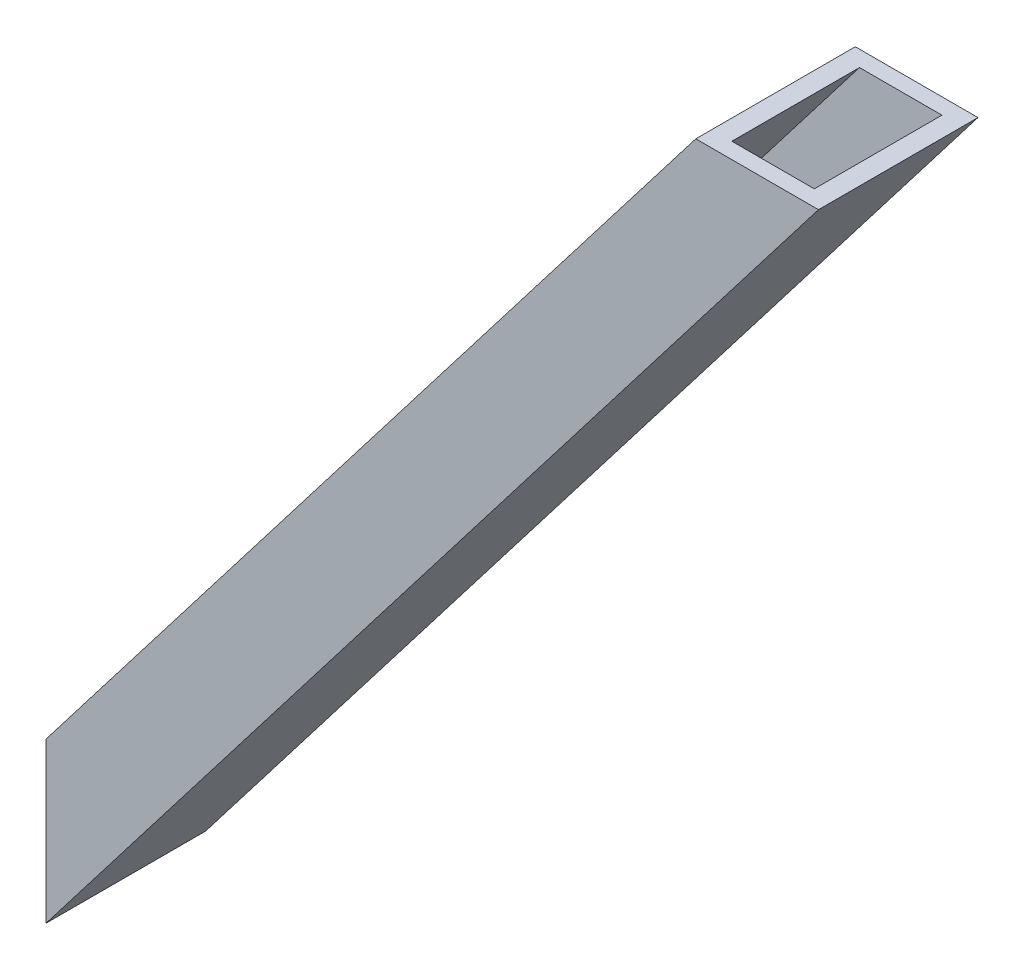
ISO-10303-21;
HEADER;
FILE_DESCRIPTION(('STEP AP214'),'2;1');
FILE_NAME('part.step','',(''),(''),'','','');
FILE_SCHEMA(('AUTOMOTIVE_DESIGN { 1 0 10303 214 1 1 1 1 }'));
ENDSEC;
DATA;
#1=APPLICATION_CONTEXT('core data for automotive mechanical design processes');
#2=APPLICATION_PROTOCOL_DEFINITION('international standard','automotive_design',2000,#1);
#3=PRODUCT_CONTEXT('',#1,'mechanical');
#4=PRODUCT('Part','Part','',(#3));
#5=PRODUCT_RELATED_PRODUCT_CATEGORY('part','',(#4));
#6=PRODUCT_DEFINITION_FORMATION('','',#4);
#7=PRODUCT_DEFINITION_CONTEXT('part definition',#1,'design');
#8=PRODUCT_DEFINITION('design','',#6,#7);
#9=PRODUCT_DEFINITION_SHAPE('','',#8);
#10=(LENGTH_UNIT() NAMED_UNIT(*) SI_UNIT(.MILLI.,.METRE.));
#11=(NAMED_UNIT(*) PLANE_ANGLE_UNIT() SI_UNIT($,.RADIAN.));
#12=(NAMED_UNIT(*) SI_UNIT($,.STERADIAN.) SOLID_ANGLE_UNIT());
#13=UNCERTAINTY_MEASURE_WITH_UNIT(LENGTH_MEASURE(1.E-05),#10,'distance_accuracy_value','');
#14=(GEOMETRIC_REPRESENTATION_CONTEXT(3) GLOBAL_UNCERTAINTY_ASSIGNED_CONTEXT((#13)) GLOBAL_UNIT_ASSIGNED_CONTEXT((#10,
#11,#12)) REPRESENTATION_CONTEXT('',''));
#15=CARTESIAN_POINT('',(0.,0.,0.));
#16=DIRECTION('',(0.,0.,1.));
#17=DIRECTION('',(1.,0.,0.));
#18=AXIS2_PLACEMENT_3D('',#15,#16,#17);
#19=CARTESIAN_POINT('',(0.,0.,20.));
#20=DIRECTION('',(1.,0.,0.));
#21=DIRECTION('',(0.,0.,-1.));
#22=AXIS2_PLACEMENT_3D('',#19,#20,#21);
#23=PLANE('',#22);
#24=DIRECTION('',(0.,-1.,0.));
#25=VECTOR('',#24,1.);
#26=CARTESIAN_POINT('',(0.,0.,0.));
#27=LINE('',#26,#25);
#28=CARTESIAN_POINT('',(0.,20.,0.));
#29=VERTEX_POINT('',#28);
#30=CARTESIAN_POINT('',(0.,0.,0.));
#31=VERTEX_POINT('',#30);
#32=EDGE_CURVE('E128',#29,#31,#27,.T.);
#33=ORIENTED_EDGE('',*,*,#32,.T.);
#34=DIRECTION('',(0.,0.,-1.));
#35=VECTOR('',#34,1.);
#36=CARTESIAN_POINT('',(0.,0.,20.));
#37=LINE('',#36,#35);
#38=CARTESIAN_POINT('',(0.,0.,20.));
#39=VERTEX_POINT('',#38);
#40=EDGE_CURVE('E45',#39,#31,#37,.T.);
#41=ORIENTED_EDGE('',*,*,#40,.F.);
#42=DIRECTION('',(0.,-1.,0.));
#43=VECTOR('',#42,1.);
#44=CARTESIAN_POINT('',(0.,0.,20.));
#45=LINE('',#44,#43);
#46=CARTESIAN_POINT('',(0.,20.,20.));
#47=VERTEX_POINT('',#46);
#48=EDGE_CURVE('E125',#47,#39,#45,.T.);
#49=ORIENTED_EDGE('',*,*,#48,.F.);
#50=DIRECTION('',(0.,0.,-1.));
#51=VECTOR('',#50,1.);
#52=CARTESIAN_POINT('',(0.,20.,20.));
#53=LINE('',#52,#51);
#54=EDGE_CURVE('E11',#47,#29,#53,.T.);
#55=ORIENTED_EDGE('',*,*,#54,.T.);
#56=EDGE_LOOP('',(#33,#41,#49,#55));
#57=FACE_BOUND('',#56,.T.);
#58=DIRECTION('',(0.,-1.,0.));
#59=VECTOR('',#58,1.);
#60=CARTESIAN_POINT('',(0.,0.,2.));
#61=LINE('',#60,#59);
#62=CARTESIAN_POINT('',(0.,16.7197561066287,2.));
#63=VERTEX_POINT('',#62);
#64=CARTESIAN_POINT('',(0.,3.28024389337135,2.));
#65=VERTEX_POINT('',#64);
#66=EDGE_CURVE('E158',#63,#65,#61,.T.);
#67=ORIENTED_EDGE('',*,*,#66,.F.);
#68=DIRECTION('',(0.,0.,-1.));
#69=VECTOR('',#68,1.);
#70=CARTESIAN_POINT('',(0.,16.7197561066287,20.));
#71=LINE('',#70,#69);
#72=CARTESIAN_POINT('',(0.,16.7197561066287,18.));
#73=VERTEX_POINT('',#72);
#74=EDGE_CURVE('E136',#73,#63,#71,.T.);
#75=ORIENTED_EDGE('',*,*,#74,.F.);
#76=DIRECTION('',(0.,-1.,0.));
#77=VECTOR('',#76,1.);
#78=CARTESIAN_POINT('',(0.,0.,18.));
#79=LINE('',#78,#77);
#80=CARTESIAN_POINT('',(0.,3.28024389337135,18.));
#81=VERTEX_POINT('',#80);
#82=EDGE_CURVE('E161',#73,#81,#79,.T.);
#83=ORIENTED_EDGE('',*,*,#82,.T.);
#84=DIRECTION('',(0.,0.,-1.));
#85=VECTOR('',#84,1.);
#86=CARTESIAN_POINT('',(0.,3.28024389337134,20.));
#87=LINE('',#86,#85);
#88=EDGE_CURVE('E162',#81,#65,#87,.T.);
#89=ORIENTED_EDGE('',*,*,#88,.T.);
#90=EDGE_LOOP('',(#67,#75,#83,#89));
#91=FACE_BOUND('',#90,.T.);
#92=ADVANCED_FACE('F37',(#57,#91),#23,.F.);
#93=CARTESIAN_POINT('',(100.,130.,20.));
#94=DIRECTION('',(-0.7926239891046,0.609710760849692,0.));
#95=DIRECTION('',(-0.609710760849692,-0.7926239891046,0.));
#96=AXIS2_PLACEMENT_3D('',#93,#94,#95);
#97=PLANE('',#96);
#98=DIRECTION('',(0.609710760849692,0.7926239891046,0.));
#99=VECTOR('',#98,1.);
#100=CARTESIAN_POINT('',(100.,130.,0.));
#101=LINE('',#100,#99);
#102=CARTESIAN_POINT('',(96.8585663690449,125.916136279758,0.));
#103=VERTEX_POINT('',#102);
#104=EDGE_CURVE('E132',#31,#103,#101,.T.);
#105=ORIENTED_EDGE('',*,*,#104,.T.);
#106=DIRECTION('',(0.,0.,1.));
#107=VECTOR('',#106,1.);
#108=CARTESIAN_POINT('',(96.8585663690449,125.916136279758,-1.));
#109=LINE('',#108,#107);
#110=CARTESIAN_POINT('',(96.8585663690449,125.916136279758,20.));
#111=VERTEX_POINT('',#110);
#112=EDGE_CURVE('E121',#103,#111,#109,.T.);
#113=ORIENTED_EDGE('',*,*,#112,.T.);
#114=DIRECTION('',(0.609710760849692,0.7926239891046,0.));
#115=VECTOR('',#114,1.);
#116=CARTESIAN_POINT('',(100.,130.,20.));
#117=LINE('',#116,#115);
#118=EDGE_CURVE('E120',#39,#111,#117,.T.);
#119=ORIENTED_EDGE('',*,*,#118,.F.);
#120=ORIENTED_EDGE('',*,*,#40,.T.);
#121=EDGE_LOOP('',(#105,#113,#119,#120));
#122=FACE_BOUND('',#121,.T.);
#123=ADVANCED_FACE('F39',(#122),#97,.F.);
#124=CARTESIAN_POINT('',(0.,20.,20.));
#125=DIRECTION('',(0.7926239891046,-0.609710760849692,0.));
#126=DIRECTION('',(0.609710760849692,0.7926239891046,0.));
#127=AXIS2_PLACEMENT_3D('',#124,#125,#126);
#128=PLANE('',#127);
#129=DIRECTION('',(-0.609710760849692,-0.7926239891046,0.));
#130=VECTOR('',#129,1.);
#131=CARTESIAN_POINT('',(0.,20.,20.));
#132=LINE('',#131,#130);
#133=CARTESIAN_POINT('',(81.4739509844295,125.916136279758,20.));
#134=VERTEX_POINT('',#133);
#135=EDGE_CURVE('E117',#134,#47,#132,.T.);
#136=ORIENTED_EDGE('',*,*,#135,.F.);
#137=DIRECTION('',(0.,0.,1.));
#138=VECTOR('',#137,1.);
#139=CARTESIAN_POINT('',(81.4739509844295,125.916136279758,-1.));
#140=LINE('',#139,#138);
#141=CARTESIAN_POINT('',(81.4739509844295,125.916136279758,0.));
#142=VERTEX_POINT('',#141);
#143=EDGE_CURVE('E102',#142,#134,#140,.T.);
#144=ORIENTED_EDGE('',*,*,#143,.F.);
#145=DIRECTION('',(-0.609710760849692,-0.7926239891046,0.));
#146=VECTOR('',#145,1.);
#147=CARTESIAN_POINT('',(0.,20.,0.));
#148=LINE('',#147,#146);
#149=EDGE_CURVE('E135',#142,#29,#148,.T.);
#150=ORIENTED_EDGE('',*,*,#149,.T.);
#151=ORIENTED_EDGE('',*,*,#54,.F.);
#152=EDGE_LOOP('',(#136,#144,#150,#151));
#153=FACE_BOUND('',#152,.T.);
#154=ADVANCED_FACE('F123',(#153),#128,.F.);
#155=CARTESIAN_POINT('',(0.,0.,20.));
#156=DIRECTION('',(0.,0.,-1.));
#157=DIRECTION('',(-1.,0.,0.));
#158=AXIS2_PLACEMENT_3D('',#155,#156,#157);
#159=PLANE('',#158);
#160=ORIENTED_EDGE('',*,*,#118,.T.);
#161=DIRECTION('',(1.,0.,0.));
#162=VECTOR('',#161,1.);
#163=CARTESIAN_POINT('',(81.4739509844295,125.916136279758,20.));
#164=LINE('',#163,#162);
#165=EDGE_CURVE('E105',#134,#111,#164,.T.);
#166=ORIENTED_EDGE('',*,*,#165,.F.);
#167=ORIENTED_EDGE('',*,*,#135,.T.);
#168=ORIENTED_EDGE('',*,*,#48,.T.);
#169=EDGE_LOOP('',(#160,#166,#167,#168));
#170=FACE_BOUND('',#169,.T.);
#171=ADVANCED_FACE('F116',(#170),#159,.F.);
#172=CARTESIAN_POINT('',(0.,0.,0.));
#173=DIRECTION('',(0.,0.,-1.));
#174=DIRECTION('',(-1.,0.,0.));
#175=AXIS2_PLACEMENT_3D('',#172,#173,#174);
#176=PLANE('',#175);
#177=DIRECTION('',(-1.,0.,0.));
#178=VECTOR('',#177,1.);
#179=CARTESIAN_POINT('',(0.,125.916136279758,0.));
#180=LINE('',#179,#178);
#181=EDGE_CURVE('E108',#103,#142,#180,.T.);
#182=ORIENTED_EDGE('',*,*,#181,.F.);
#183=ORIENTED_EDGE('',*,*,#104,.F.);
#184=ORIENTED_EDGE('',*,*,#32,.F.);
#185=ORIENTED_EDGE('',*,*,#149,.F.);
#186=EDGE_LOOP('',(#182,#183,#184,#185));
#187=FACE_BOUND('',#186,.T.);
#188=ADVANCED_FACE('F145',(#187),#176,.T.);
#189=CARTESIAN_POINT('',(98.4147520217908,131.219421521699,20.));
#190=DIRECTION('',(-0.7926239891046,0.609710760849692,0.));
#191=DIRECTION('',(-0.609710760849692,-0.7926239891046,0.));
#192=AXIS2_PLACEMENT_3D('',#189,#190,#191);
#193=PLANE('',#192);
#194=DIRECTION('',(0.,0.,1.));
#195=VECTOR('',#194,1.);
#196=CARTESIAN_POINT('',(94.3353018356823,125.916136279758,20.));
#197=LINE('',#196,#195);
#198=CARTESIAN_POINT('',(94.3353018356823,125.916136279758,2.));
#199=VERTEX_POINT('',#198);
#200=CARTESIAN_POINT('',(94.3353018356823,125.916136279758,18.));
#201=VERTEX_POINT('',#200);
#202=EDGE_CURVE('E148',#199,#201,#197,.T.);
#203=ORIENTED_EDGE('',*,*,#202,.F.);
#204=DIRECTION('',(0.609710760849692,0.7926239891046,0.));
#205=VECTOR('',#204,1.);
#206=CARTESIAN_POINT('',(-1.5852479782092,1.21942152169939,2.));
#207=LINE('',#206,#205);
#208=EDGE_CURVE('E112',#65,#199,#207,.T.);
#209=ORIENTED_EDGE('',*,*,#208,.F.);
#210=ORIENTED_EDGE('',*,*,#88,.F.);
#211=DIRECTION('',(0.609710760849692,0.7926239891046,0.));
#212=VECTOR('',#211,1.);
#213=CARTESIAN_POINT('',(-1.5852479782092,1.21942152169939,18.));
#214=LINE('',#213,#212);
#215=EDGE_CURVE('E155',#81,#201,#214,.T.);
#216=ORIENTED_EDGE('',*,*,#215,.T.);
#217=EDGE_LOOP('',(#203,#209,#210,#216));
#218=FACE_BOUND('',#217,.T.);
#219=ADVANCED_FACE('F176',(#218),#193,.T.);
#220=CARTESIAN_POINT('',(1.5852479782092,18.7805784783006,20.));
#221=DIRECTION('',(0.7926239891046,-0.609710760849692,0.));
#222=DIRECTION('',(0.609710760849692,0.7926239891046,0.));
#223=AXIS2_PLACEMENT_3D('',#220,#221,#222);
#224=PLANE('',#223);
#225=DIRECTION('',(0.,0.,-1.));
#226=VECTOR('',#225,1.);
#227=CARTESIAN_POINT('',(83.9972155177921,125.916136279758,20.));
#228=LINE('',#227,#226);
#229=CARTESIAN_POINT('',(83.9972155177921,125.916136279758,18.));
#230=VERTEX_POINT('',#229);
#231=CARTESIAN_POINT('',(83.9972155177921,125.916136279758,2.));
#232=VERTEX_POINT('',#231);
#233=EDGE_CURVE('E52',#230,#232,#228,.T.);
#234=ORIENTED_EDGE('',*,*,#233,.F.);
#235=DIRECTION('',(-0.609710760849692,-0.7926239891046,0.));
#236=VECTOR('',#235,1.);
#237=CARTESIAN_POINT('',(-8.08017953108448,6.21552271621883,18.));
#238=LINE('',#237,#236);
#239=EDGE_CURVE('E59',#230,#73,#238,.T.);
#240=ORIENTED_EDGE('',*,*,#239,.T.);
#241=ORIENTED_EDGE('',*,*,#74,.T.);
#242=DIRECTION('',(-0.609710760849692,-0.7926239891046,0.));
#243=VECTOR('',#242,1.);
#244=CARTESIAN_POINT('',(-8.08017953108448,6.21552271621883,2.));
#245=LINE('',#244,#243);
#246=EDGE_CURVE('E154',#232,#63,#245,.T.);
#247=ORIENTED_EDGE('',*,*,#246,.F.);
#248=EDGE_LOOP('',(#234,#240,#241,#247));
#249=FACE_BOUND('',#248,.T.);
#250=ADVANCED_FACE('F181',(#249),#224,.T.);
#251=CARTESIAN_POINT('',(0.,0.,18.));
#252=DIRECTION('',(0.,0.,-1.));
#253=DIRECTION('',(-1.,0.,0.));
#254=AXIS2_PLACEMENT_3D('',#251,#252,#253);
#255=PLANE('',#254);
#256=DIRECTION('',(-1.,0.,0.));
#257=VECTOR('',#256,1.);
#258=CARTESIAN_POINT('',(0.,125.916136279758,18.));
#259=LINE('',#258,#257);
#260=EDGE_CURVE('E146',#201,#230,#259,.T.);
#261=ORIENTED_EDGE('',*,*,#260,.F.);
#262=ORIENTED_EDGE('',*,*,#215,.F.);
#263=ORIENTED_EDGE('',*,*,#82,.F.);
#264=ORIENTED_EDGE('',*,*,#239,.F.);
#265=EDGE_LOOP('',(#261,#262,#263,#264));
#266=FACE_BOUND('',#265,.T.);
#267=ADVANCED_FACE('F180',(#266),#255,.T.);
#268=CARTESIAN_POINT('',(0.,0.,2.));
#269=DIRECTION('',(0.,0.,-1.));
#270=DIRECTION('',(-1.,0.,0.));
#271=AXIS2_PLACEMENT_3D('',#268,#269,#270);
#272=PLANE('',#271);
#273=ORIENTED_EDGE('',*,*,#208,.T.);
#274=DIRECTION('',(-1.,0.,0.));
#275=VECTOR('',#274,1.);
#276=CARTESIAN_POINT('',(0.,125.916136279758,2.));
#277=LINE('',#276,#275);
#278=EDGE_CURVE('E182',#199,#232,#277,.T.);
#279=ORIENTED_EDGE('',*,*,#278,.T.);
#280=ORIENTED_EDGE('',*,*,#246,.T.);
#281=ORIENTED_EDGE('',*,*,#66,.T.);
#282=EDGE_LOOP('',(#273,#279,#280,#281));
#283=FACE_BOUND('',#282,.T.);
#284=ADVANCED_FACE('F170',(#283),#272,.F.);
#285=CARTESIAN_POINT('',(81.4739509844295,125.916136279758,-1.));
#286=DIRECTION('',(0.,-1.,0.));
#287=DIRECTION('',(0.,0.,-1.));
#288=AXIS2_PLACEMENT_3D('',#285,#286,#287);
#289=PLANE('',#288);
#290=ORIENTED_EDGE('',*,*,#181,.T.);
#291=ORIENTED_EDGE('',*,*,#143,.T.);
#292=ORIENTED_EDGE('',*,*,#165,.T.);
#293=ORIENTED_EDGE('',*,*,#112,.F.);
#294=EDGE_LOOP('',(#290,#291,#292,#293));
#295=FACE_BOUND('',#294,.T.);
#296=ORIENTED_EDGE('',*,*,#260,.T.);
#297=ORIENTED_EDGE('',*,*,#233,.T.);
#298=ORIENTED_EDGE('',*,*,#278,.F.);
#299=ORIENTED_EDGE('',*,*,#202,.T.);
#300=EDGE_LOOP('',(#296,#297,#298,#299));
#301=FACE_BOUND('',#300,.T.);
#302=ADVANCED_FACE('F104',(#295,#301),#289,.F.);
#303=CLOSED_SHELL('',(#92,#123,#154,#171,#188,#219,#250,#267,#284,#302));
#304=MANIFOLD_SOLID_BREP('B2',#303);
#305=ADVANCED_BREP_SHAPE_REPRESENTATION('',(#18,#304),#14);
#306=SHAPE_DEFINITION_REPRESENTATION(#9,#305);
ENDSEC;
END-ISO-10303-21;
